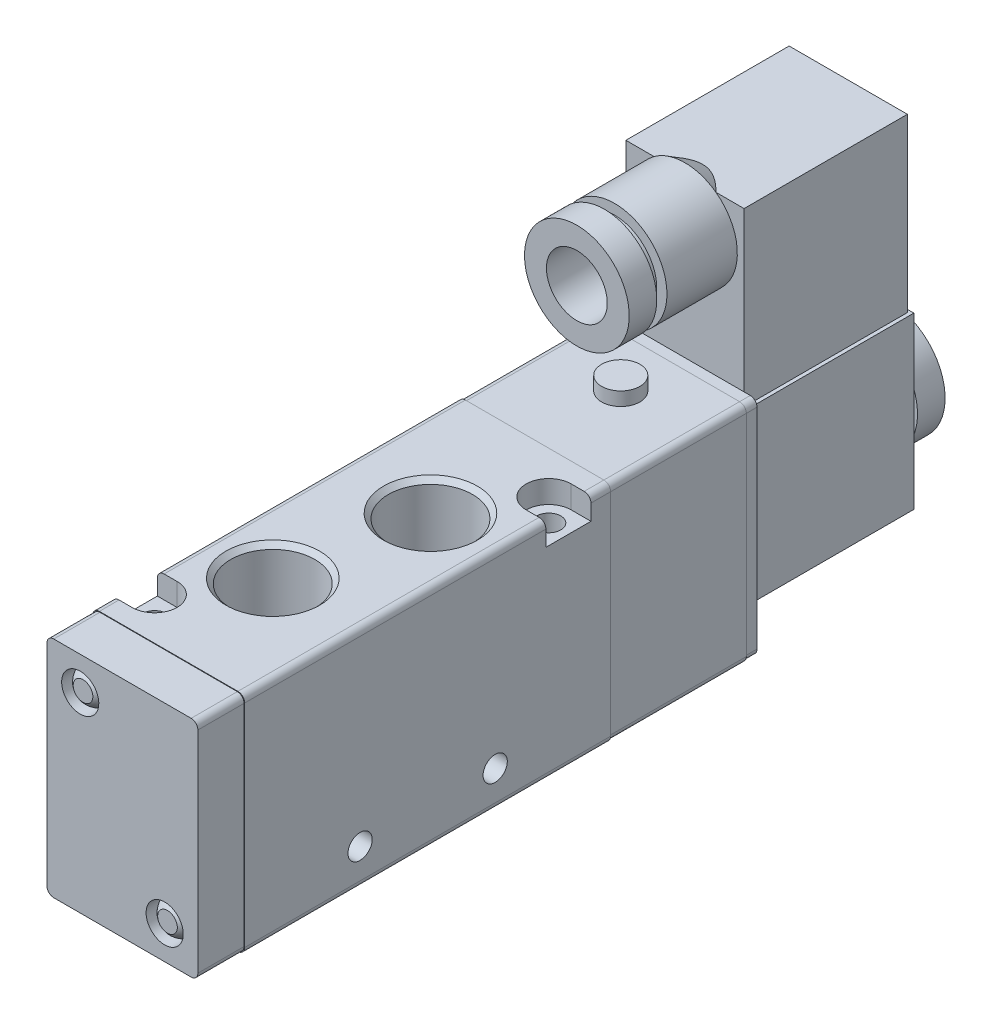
from build123d import *

# Parameters (mm, degrees)
EXTRUDE_1_DEPTH          = 65
CUT_EXTRUDE_1_DEPTH      = 20
CUT_EXTRUDE_1_DEPTH_BACK = 20
SKETCH_2_R               = 2.15
CUT_EXTRUDE_2_DEPTH      = 20
CUT_EXTRUDE_2_DEPTH_BACK = 20
SKETCH_3_R               = 2.15
CUT_EXTRUDE_3_DEPTH      = 4
CUT_EXTRUDE_4_DEPTH      = 4
CUT_EXTRUDE_5_DEPTH      = 13.5
CUT_EXTRUDE_5_DEPTH_BACK = 13.5
SKETCH_11_R              = 2.15
CUT_EXTRUDE_6_DEPTH      = 13.5
CUT_EXTRUDE_6_DEPTH_BACK = 13.5
SKETCH_12_R              = 2.15
EXTRUDE_2_DEPTH          = 8.2
EXTRUDE_START            = -24.2
EXTRUDE_3_DEPTH          = 24.2
SKETCH_17_W              = 3.4
SKETCH_17_H              = 2.4
EXTRUDE_4_DEPTH          = 26.2
SKETCH_19_W              = 22.3
SKETCH_19_H              = 30
EXTRUDE_5_DEPTH          = 30.2
SKETCH_21_W              = 21
SKETCH_21_H              = 29
EXTRUDE_6_DEPTH          = 47.5


with BuildPart() as part:
    # Sketch 1 → Extrude 1 (new body)
    with BuildSketch(Plane.XY):
        with BuildLine():
            Line((-13.5, 18.8), (-13.5, -18.8))
            ThreePointArc((-13.5, -18.8), (-13.148528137, -19.648528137), (-12.3, -20))
            Line((-12.3, -20), (12.3, -20))
            ThreePointArc((12.3, -20), (13.148528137, -19.648528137), (13.5, -18.8))
            Line((13.5, -18.8), (13.5, 18.8))
            ThreePointArc((13.5, 18.8), (13.148528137, 19.648528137), (12.3, 20))
            Line((12.3, 20), (-12.3, 20))
            ThreePointArc((-12.3, 20), (-13.148528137, 19.648528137), (-13.5, 18.8))
        make_face()
    extrude(amount=-EXTRUDE_1_DEPTH)

    # Sketch 2 → Cut-Extrude 1 (cut, two sides: drawn at the far end of the back side and taken through both)
    with BuildSketch(Plane(origin=(0, 0, 0), x_dir=(1, 0, 0), z_dir=(0, 1, 0)).offset(-CUT_EXTRUDE_1_DEPTH_BACK)):
        with Locations(Location((-10, 7.5, 0), (0, 0, 270))):
            Circle(SKETCH_2_R)
    extrude(amount=CUT_EXTRUDE_1_DEPTH + CUT_EXTRUDE_1_DEPTH_BACK, mode=Mode.SUBTRACT)

    # Sketch 3 → Cut-Extrude 2 (cut, two sides: drawn at the far end of the back side and taken through both)
    with BuildSketch(Plane(origin=(0, 0, 0), x_dir=(1, 0, 0), z_dir=(0, 1, 0)).offset(-CUT_EXTRUDE_2_DEPTH_BACK)):
        with Locations(Location((10, 57.5, 0), (0, 0, 270))):
            Circle(SKETCH_3_R)
    extrude(amount=CUT_EXTRUDE_2_DEPTH + CUT_EXTRUDE_2_DEPTH_BACK, mode=Mode.SUBTRACT)

    # Sketch 4 → Cut-Extrude 3 (cut)
    with BuildSketch(Plane(origin=(0, 20, 0), x_dir=(1, 0, 0), z_dir=(0, 1, 0))):
        with BuildLine():
            Line((-13.5, 11.5), (-13.5, 3.5))
            Line((-13.5, 3.5), (-10, 3.5))
            ThreePointArc((-10, 3.5), (-6, 7.5), (-10, 11.5))
            Line((-10, 11.5), (-13.5, 11.5))
        make_face()
    extrude(amount=-CUT_EXTRUDE_3_DEPTH, mode=Mode.SUBTRACT)

    # Sketch 5 → Cut-Extrude 4 (cut)
    with BuildSketch(Plane(origin=(0, 20, 0), x_dir=(1, 0, 0), z_dir=(0, 1, 0))):
        with BuildLine():
            Line((10, 53.5), (13.5, 53.5))
            Line((13.5, 53.5), (13.5, 61.5))
            Line((13.5, 61.5), (10, 61.5))
            ThreePointArc((10, 61.5), (6, 57.5), (10, 53.5))
        make_face()
    extrude(amount=-CUT_EXTRUDE_4_DEPTH, mode=Mode.SUBTRACT)

    # Sketch 6 → Cut-Revolve 1 (revolve, cut)
    with BuildSketch(Plane.XY.offset(-20.5), mode=Mode.PRIVATE) as cut_revolve_1_sk:
        Polygon((-2, 6.666666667), (-9.475, 6.666666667), (-9.475, 19.144), (-10.331, 20), (-2, 20), align=None)
    revolve(cut_revolve_1_sk.sketch.rotate(Axis((-2, 20, -20.5), (0, -1, 0)), 90), axis=Axis((-2, 20, -20.5), (0, -1, 0)), mode=Mode.SUBTRACT)

    # Sketch 7 → Cut-Revolve 2 (revolve, cut)
    with BuildSketch(Plane.XY.offset(-44.5), mode=Mode.PRIVATE) as cut_revolve_2_sk:
        Polygon((2, 20), (10.331, 20), (9.475, 19.144), (9.475, 6.666666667), (2, 6.666666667), align=None)
    revolve(cut_revolve_2_sk.sketch.rotate(Axis((2, 6.666666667, -44.5), (0, 1, 0)), 270), axis=Axis((2, 6.666666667, -44.5), (0, 1, 0)), mode=Mode.SUBTRACT)

    # Sketch 8 → Cut-Revolve 3 (revolve, cut)
    with BuildSketch(Plane(origin=(0, 0, 0), x_dir=(0, 0, -1), z_dir=(1, 0, 0)), mode=Mode.PRIVATE) as cut_revolve_3_sk:
        Polygon((10, -6.666666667), (15.7225, -6.666666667), (15.7225, -19.144), (16.5785, -20), (10, -20), align=None)
    revolve(cut_revolve_3_sk.sketch.rotate(Axis((0, -20, -10), (0, 1, 0)), 180), axis=Axis((0, -20, -10), (0, 1, 0)), mode=Mode.SUBTRACT)

    # Sketch 9 → Cut-Revolve 4 (revolve, cut)
    with BuildSketch(Plane(origin=(0, 0, 0), x_dir=(0, 0, -1), z_dir=(1, 0, 0)), mode=Mode.PRIVATE) as cut_revolve_4_sk:
        Polygon((32.5, -20), (24.169, -20), (25.025, -19.144), (25.025, -6.666666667), (32.5, -6.666666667), align=None)
    revolve(cut_revolve_4_sk.sketch.rotate(Axis((0, -6.666666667, -32.5), (0, -1, 0)), 180), axis=Axis((0, -6.666666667, -32.5), (0, -1, 0)), mode=Mode.SUBTRACT)

    # Sketch 10 → Cut-Revolve 5 (revolve, cut)
    with BuildSketch(Plane(origin=(0, 0, 0), x_dir=(0, 0, -1), z_dir=(1, 0, 0)), mode=Mode.PRIVATE) as cut_revolve_5_sk:
        Polygon((55, -6.666666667), (60.7225, -6.666666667), (60.7225, -19.144), (61.5785, -20), (55, -20), align=None)
    revolve(cut_revolve_5_sk.sketch.rotate(Axis((0, -20, -55), (0, 1, 0)), 180), axis=Axis((0, -20, -55), (0, 1, 0)), mode=Mode.SUBTRACT)

    # Sketch 11 → Cut-Extrude 5 (cut, two sides: drawn at the far end of the back side and taken through both)
    with BuildSketch(Plane(origin=(0, 0, 0), x_dir=(0, 0, -1), z_dir=(1, 0, 0)).offset(-CUT_EXTRUDE_5_DEPTH_BACK)):
        with Locations((20.5, -13.5)):
            Circle(SKETCH_11_R)
    extrude(amount=CUT_EXTRUDE_5_DEPTH + CUT_EXTRUDE_5_DEPTH_BACK, mode=Mode.SUBTRACT)

    # Sketch 12 → Cut-Extrude 6 (cut, two sides: drawn at the far end of the back side and taken through both)
    with BuildSketch(Plane(origin=(0, 0, 0), x_dir=(0, 0, -1), z_dir=(1, 0, 0)).offset(-CUT_EXTRUDE_6_DEPTH_BACK)):
        with Locations((44.5, -13.5)):
            Circle(SKETCH_12_R)
    extrude(amount=CUT_EXTRUDE_6_DEPTH + CUT_EXTRUDE_6_DEPTH_BACK, mode=Mode.SUBTRACT)

    # Sketch 13 → Extrude 2 (add)
    with BuildSketch(Plane.XY):
        with BuildLine():
            Line((-13.4, 18.7), (-13.4, -18.7))
            ThreePointArc((-13.4, -18.7), (-13.048528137, -19.548528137), (-12.2, -19.9))
            Line((-12.2, -19.9), (12.2, -19.9))
            ThreePointArc((12.2, -19.9), (13.048528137, -19.548528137), (13.4, -18.7))
            Line((13.4, -18.7), (13.4, 18.7))
            ThreePointArc((13.4, 18.7), (13.048528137, 19.548528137), (12.2, 19.9))
            Line((12.2, 19.9), (-12.2, 19.9))
            ThreePointArc((-12.2, 19.9), (-13.048528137, 19.548528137), (-13.4, 18.7))
        make_face()
    extrude(amount=EXTRUDE_2_DEPTH)

    # Sketch 14 → Cut-Revolve 6 (revolve, cut)
    with BuildSketch(Plane(origin=(7.5, 0, 0), x_dir=(0, 0, -1), z_dir=(1, 0, 0)), mode=Mode.PRIVATE) as cut_revolve_6_sk:
        with BuildLine():
            Line((-8.2, -14), (-8.2, -10.7))
            Line((-8.2, -10.7), (-4.9, -10.7))
            ThreePointArc((-4.9, -10.7), (-6.501061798, -11.114414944), (-7.7, -12.25357508))
            Line((-7.7, -12.25357508), (-7.7, -14))
            Line((-7.7, -14), (-8.2, -14))
        make_face()
    revolve(cut_revolve_6_sk.sketch.rotate(Axis((7.5, -14, 4.9), (0, 0, 1)), 180), axis=Axis((7.5, -14, 4.9), (0, 0, 1)), mode=Mode.SUBTRACT)

    # Sketch 15 → Cut-Revolve 7 (revolve, cut)
    with BuildSketch(Plane(origin=(-7.5, 0, 0), x_dir=(0, 0, -1), z_dir=(1, 0, 0)), mode=Mode.PRIVATE) as cut_revolve_7_sk:
        with BuildLine():
            Line((-8.2, 14), (-8.2, 17.3))
            Line((-8.2, 17.3), (-4.9, 17.3))
            ThreePointArc((-4.9, 17.3), (-6.501061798, 16.885585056), (-7.7, 15.74642492))
            Line((-7.7, 15.74642492), (-7.7, 14))
            Line((-7.7, 14), (-8.2, 14))
        make_face()
    revolve(cut_revolve_7_sk.sketch.rotate(Axis((-7.5, 14, 4.9), (0, 0, 1)), 180), axis=Axis((-7.5, 14, 4.9), (0, 0, 1)), mode=Mode.SUBTRACT)

    # Sketch 16 → Extrude 3 (add)
    with BuildSketch(Plane.XY.offset(-65).offset(EXTRUDE_START)):
        with BuildLine():
            Line((-13.4, 18.7), (-13.4, -18.7))
            ThreePointArc((-13.4, -18.7), (-13.048528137, -19.548528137), (-12.2, -19.9))
            Line((-12.2, -19.9), (12.2, -19.9))
            ThreePointArc((12.2, -19.9), (13.048528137, -19.548528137), (13.4, -18.7))
            Line((13.4, -18.7), (13.4, 18.7))
            ThreePointArc((13.4, 18.7), (13.048528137, 19.548528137), (12.2, 19.9))
            Line((12.2, 19.9), (-12.2, 19.9))
            ThreePointArc((-12.2, 19.9), (-13.048528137, 19.548528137), (-13.4, 18.7))
        make_face()
    extrude(amount=EXTRUDE_3_DEPTH)

    # Sketch 17 → Revolve 1 (revolve)
    with BuildSketch(Plane(origin=(0, 0, 0), x_dir=(0, 0, -1), z_dir=(1, 0, 0)), mode=Mode.PRIVATE) as revolve_1_sk:
        with Locations((82, 21.1)):
            Rectangle(SKETCH_17_W, SKETCH_17_H)
    revolve(revolve_1_sk.sketch.rotate(Axis((0, 19.9, -80.3), (0, 1, 0)), 180), axis=Axis((0, 19.9, -80.3), (0, 1, 0)))

    # Sketch 18 → Extrude 4 (add)
    with BuildSketch(Plane.XY.offset(-65)):
        with BuildLine():
            Line((-13.3, 18.6), (-13.3, -18.6))
            ThreePointArc((-13.3, -18.6), (-12.948528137, -19.448528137), (-12.1, -19.8))
            Line((-12.1, -19.8), (12.1, -19.8))
            ThreePointArc((12.1, -19.8), (12.948528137, -19.448528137), (13.3, -18.6))
            Line((13.3, -18.6), (13.3, 18.6))
            ThreePointArc((13.3, 18.6), (12.948528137, 19.448528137), (12.1, 19.8))
            Line((12.1, 19.8), (-12.1, 19.8))
            ThreePointArc((-12.1, 19.8), (-12.948528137, 19.448528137), (-13.3, 18.6))
        make_face()
    extrude(amount=-EXTRUDE_4_DEPTH)

    # Sketch 19 → Extrude 5 (add)
    with BuildSketch(Plane(origin=(0, -13.2, 0), x_dir=(1, 0, 0), z_dir=(0, 1, 0))):
        with Locations((0, 106.2)):
            Rectangle(SKETCH_19_W, SKETCH_19_H)
    extrude(amount=EXTRUDE_5_DEPTH)

    # Sketch 20 → Revolve 2 (revolve)
    with BuildSketch(Plane(origin=(0, 0, 0), x_dir=(1, 0, 0), z_dir=(0, 1, 0)), mode=Mode.PRIVATE) as revolve_2_sk:
        Polygon((0, 127.9), (10, 127.9), (10, 123), (7.5, 123), (7.5, 122), (10, 122), (10, 121.2), (0, 121.2), align=None)
    revolve(revolve_2_sk.sketch.rotate(Axis((0, 0, -121.2), (0, 0, -1)), 180), axis=Axis((0, 0, -121.2), (0, 0, -1)))

    # Sketch 21 → Extrude 6 (add)
    with BuildSketch(Plane(origin=(0, 0, 0), x_dir=(1, 0, 0), z_dir=(0, 1, 0))):
        with Locations((0, 106.2)):
            Rectangle(SKETCH_21_W, SKETCH_21_H)
    extrude(amount=EXTRUDE_6_DEPTH)

    # Sketch 22 → Revolve 3 (revolve)
    with BuildSketch(Plane(origin=(0, 0, 0), x_dir=(0, 0, -1), z_dir=(1, 0, 0)), mode=Mode.PRIVATE) as revolve_3_sk:
        Polygon((107.80807251, 40), (91.7, 30.7), (79.2, 30.7), (79.2, 32.5), (77.4, 32.5), (77.4, 30.7), (72.5, 30.7), (72.5, 34.6), (91.7, 34.6), (91.7, 40), align=None)
    revolve(revolve_3_sk.sketch.rotate(Axis((0, 40, -72.5), (0, 0, -1)), 90), axis=Axis((0, 40, -72.5), (0, 0, -1)))


solid = part.part
